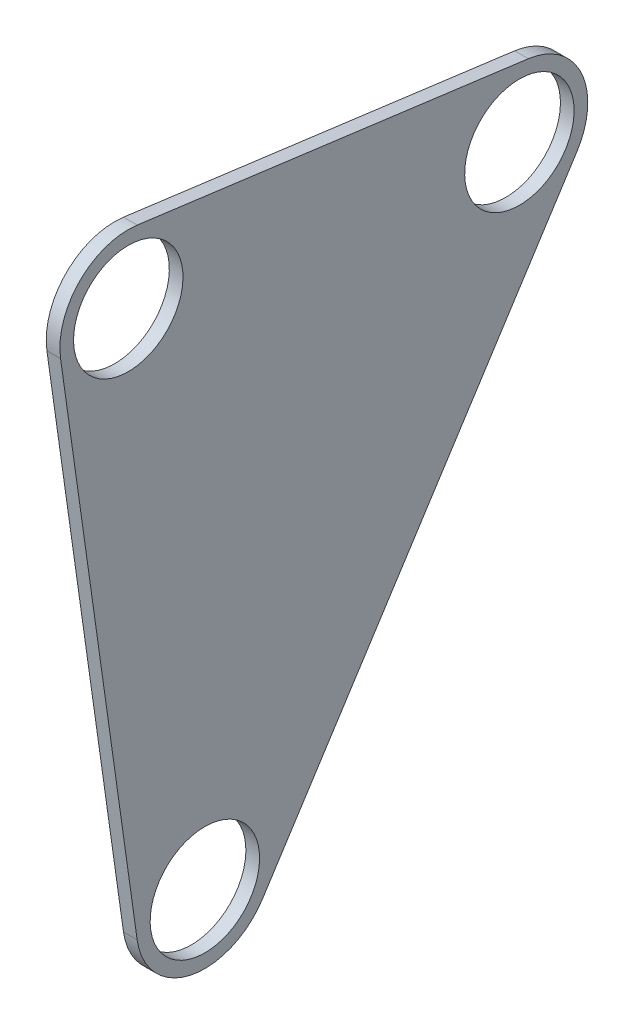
ISO-10303-21;
HEADER;
FILE_DESCRIPTION(('STEP AP214'),'2;1');
FILE_NAME('part.step','',(''),(''),'','','');
FILE_SCHEMA(('AUTOMOTIVE_DESIGN { 1 0 10303 214 1 1 1 1 }'));
ENDSEC;
DATA;
#1=APPLICATION_CONTEXT('core data for automotive mechanical design processes');
#2=APPLICATION_PROTOCOL_DEFINITION('international standard','automotive_design',2000,#1);
#3=PRODUCT_CONTEXT('',#1,'mechanical');
#4=PRODUCT('Part','Part','',(#3));
#5=PRODUCT_RELATED_PRODUCT_CATEGORY('part','',(#4));
#6=PRODUCT_DEFINITION_FORMATION('','',#4);
#7=PRODUCT_DEFINITION_CONTEXT('part definition',#1,'design');
#8=PRODUCT_DEFINITION('design','',#6,#7);
#9=PRODUCT_DEFINITION_SHAPE('','',#8);
#10=(LENGTH_UNIT() NAMED_UNIT(*) SI_UNIT(.MILLI.,.METRE.));
#11=(NAMED_UNIT(*) PLANE_ANGLE_UNIT() SI_UNIT($,.RADIAN.));
#12=(NAMED_UNIT(*) SI_UNIT($,.STERADIAN.) SOLID_ANGLE_UNIT());
#13=UNCERTAINTY_MEASURE_WITH_UNIT(LENGTH_MEASURE(1.E-05),#10,'distance_accuracy_value','');
#14=(GEOMETRIC_REPRESENTATION_CONTEXT(3) GLOBAL_UNCERTAINTY_ASSIGNED_CONTEXT((#13)) GLOBAL_UNIT_ASSIGNED_CONTEXT((#10,
#11,#12)) REPRESENTATION_CONTEXT('',''));
#15=CARTESIAN_POINT('',(0.,0.,0.));
#16=DIRECTION('',(0.,0.,1.));
#17=DIRECTION('',(1.,0.,0.));
#18=AXIS2_PLACEMENT_3D('',#15,#16,#17);
#19=CARTESIAN_POINT('',(525.90938788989,1343.37657091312,1445.07249873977));
#20=DIRECTION('',(-1.,0.,0.));
#21=DIRECTION('',(0.,-1.,0.));
#22=AXIS2_PLACEMENT_3D('',#19,#20,#21);
#23=PLANE('',#22);
#24=CARTESIAN_POINT('',(525.90938788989,1343.37657091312,1445.07249873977));
#25=DIRECTION('',(1.,0.,0.));
#26=DIRECTION('',(0.,-1.,0.));
#27=AXIS2_PLACEMENT_3D('',#24,#25,#26);
#28=CIRCLE('',#27,12.5);
#29=CARTESIAN_POINT('',(525.90938788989,1355.76963168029,1443.44092133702));
#30=VERTEX_POINT('',#29);
#31=CARTESIAN_POINT('',(525.90938788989,1341.62657091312,1457.44939253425));
#32=VERTEX_POINT('',#31);
#33=EDGE_CURVE('E128',#30,#32,#28,.T.);
#34=ORIENTED_EDGE('',*,*,#33,.T.);
#35=DIRECTION('',(0.,-0.990151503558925,-0.139999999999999));
#36=VECTOR('',#35,1.);
#37=CARTESIAN_POINT('',(525.90938788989,1242.61142055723,1443.44939253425));
#38=LINE('',#37,#36);
#39=CARTESIAN_POINT('',(525.90938788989,1242.61142055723,1443.44939253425));
#40=VERTEX_POINT('',#39);
#41=EDGE_CURVE('E86',#32,#40,#38,.T.);
#42=ORIENTED_EDGE('',*,*,#41,.T.);
#43=CARTESIAN_POINT('',(525.90938788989,1244.36142055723,1431.07249873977));
#44=DIRECTION('',(1.,0.,0.));
#45=DIRECTION('',(0.,-1.,0.));
#46=AXIS2_PLACEMENT_3D('',#43,#44,#45);
#47=CIRCLE('',#46,12.4999999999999);
#48=CARTESIAN_POINT('',(525.90938788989,1237.61036715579,1420.55236195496));
#49=VERTEX_POINT('',#48);
#50=EDGE_CURVE('E99',#40,#49,#47,.T.);
#51=ORIENTED_EDGE('',*,*,#50,.T.);
#52=DIRECTION('',(0.,0.841610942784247,-0.540084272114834));
#53=VECTOR('',#52,1.);
#54=CARTESIAN_POINT('',(525.90938788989,1237.61036715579,1420.55236195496));
#55=LINE('',#54,#53);
#56=CARTESIAN_POINT('',(525.90938788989,1327.21236393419,1363.05236195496));
#57=VERTEX_POINT('',#56);
#58=EDGE_CURVE('E93',#49,#57,#55,.T.);
#59=ORIENTED_EDGE('',*,*,#58,.T.);
#60=CARTESIAN_POINT('',(525.90938788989,1333.96341733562,1373.57249873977));
#61=DIRECTION('',(1.,0.,0.));
#62=DIRECTION('',(0.,-1.,0.));
#63=AXIS2_PLACEMENT_3D('',#60,#61,#62);
#64=CIRCLE('',#63,12.5000000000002);
#65=CARTESIAN_POINT('',(525.90938788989,1346.3564781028,1371.94092133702));
#66=VERTEX_POINT('',#65);
#67=EDGE_CURVE('E97',#57,#66,#64,.T.);
#68=ORIENTED_EDGE('',*,*,#67,.T.);
#69=DIRECTION('',(0.,0.130526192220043,0.991444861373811));
#70=VECTOR('',#69,1.);
#71=CARTESIAN_POINT('',(525.90938788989,1346.3564781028,1371.94092133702));
#72=LINE('',#71,#70);
#73=EDGE_CURVE('E49',#66,#30,#72,.T.);
#74=ORIENTED_EDGE('',*,*,#73,.T.);
#75=EDGE_LOOP('',(#34,#42,#51,#59,#68,#74));
#76=FACE_BOUND('',#75,.T.);
#77=CARTESIAN_POINT('',(525.90938788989,1343.37657091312,1445.07249873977));
#78=DIRECTION('',(1.,0.,0.));
#79=DIRECTION('',(0.,1.,0.));
#80=AXIS2_PLACEMENT_3D('',#77,#78,#79);
#81=CIRCLE('',#80,10.0000000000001);
#82=CARTESIAN_POINT('',(525.90938788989,1353.37657091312,1445.07249873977));
#83=VERTEX_POINT('',#82);
#84=EDGE_CURVE('E121',#83,#83,#81,.T.);
#85=ORIENTED_EDGE('',*,*,#84,.F.);
#86=EDGE_LOOP('',(#85));
#87=FACE_BOUND('',#86,.T.);
#88=CARTESIAN_POINT('',(525.90938788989,1244.36142055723,1431.07249873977));
#89=DIRECTION('',(1.,0.,0.));
#90=DIRECTION('',(0.,1.,0.));
#91=AXIS2_PLACEMENT_3D('',#88,#89,#90);
#92=CIRCLE('',#91,10.0000000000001);
#93=CARTESIAN_POINT('',(525.90938788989,1254.36142055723,1431.07249873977));
#94=VERTEX_POINT('',#93);
#95=EDGE_CURVE('E182',#94,#94,#92,.T.);
#96=ORIENTED_EDGE('',*,*,#95,.F.);
#97=EDGE_LOOP('',(#96));
#98=FACE_BOUND('',#97,.T.);
#99=CARTESIAN_POINT('',(525.90938788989,1333.96341733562,1373.57249873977));
#100=DIRECTION('',(1.,0.,0.));
#101=DIRECTION('',(0.,1.,0.));
#102=AXIS2_PLACEMENT_3D('',#99,#100,#101);
#103=CIRCLE('',#102,10.0000000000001);
#104=CARTESIAN_POINT('',(525.90938788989,1343.96341733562,1373.57249873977));
#105=VERTEX_POINT('',#104);
#106=EDGE_CURVE('E173',#105,#105,#103,.T.);
#107=ORIENTED_EDGE('',*,*,#106,.F.);
#108=EDGE_LOOP('',(#107));
#109=FACE_BOUND('',#108,.T.);
#110=ADVANCED_FACE('F32',(#76,#87,#98,#109),#23,.F.);
#111=CARTESIAN_POINT('',(523.40938788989,1343.37657091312,1445.07249873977));
#112=DIRECTION('',(-1.,0.,0.));
#113=DIRECTION('',(0.,-1.,0.));
#114=AXIS2_PLACEMENT_3D('',#111,#112,#113);
#115=PLANE('',#114);
#116=CARTESIAN_POINT('',(523.40938788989,1244.36142055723,1431.07249873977));
#117=DIRECTION('',(1.,0.,0.));
#118=DIRECTION('',(0.,1.,0.));
#119=AXIS2_PLACEMENT_3D('',#116,#117,#118);
#120=CIRCLE('',#119,10.0000000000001);
#121=CARTESIAN_POINT('',(523.40938788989,1254.36142055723,1431.07249873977));
#122=VERTEX_POINT('',#121);
#123=EDGE_CURVE('E179',#122,#122,#120,.T.);
#124=ORIENTED_EDGE('',*,*,#123,.T.);
#125=EDGE_LOOP('',(#124));
#126=FACE_BOUND('',#125,.T.);
#127=CARTESIAN_POINT('',(523.40938788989,1343.37657091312,1445.07249873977));
#128=DIRECTION('',(1.,0.,0.));
#129=DIRECTION('',(0.,-1.,0.));
#130=AXIS2_PLACEMENT_3D('',#127,#128,#129);
#131=CIRCLE('',#130,12.5);
#132=CARTESIAN_POINT('',(523.40938788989,1355.76963168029,1443.44092133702));
#133=VERTEX_POINT('',#132);
#134=CARTESIAN_POINT('',(523.40938788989,1341.62657091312,1457.44939253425));
#135=VERTEX_POINT('',#134);
#136=EDGE_CURVE('E117',#133,#135,#131,.T.);
#137=ORIENTED_EDGE('',*,*,#136,.F.);
#138=DIRECTION('',(0.,0.130526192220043,0.991444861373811));
#139=VECTOR('',#138,1.);
#140=CARTESIAN_POINT('',(523.40938788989,1346.3564781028,1371.94092133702));
#141=LINE('',#140,#139);
#142=CARTESIAN_POINT('',(523.40938788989,1346.3564781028,1371.94092133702));
#143=VERTEX_POINT('',#142);
#144=EDGE_CURVE('E78',#143,#133,#141,.T.);
#145=ORIENTED_EDGE('',*,*,#144,.F.);
#146=CARTESIAN_POINT('',(523.40938788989,1333.96341733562,1373.57249873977));
#147=DIRECTION('',(1.,0.,0.));
#148=DIRECTION('',(0.,-1.,0.));
#149=AXIS2_PLACEMENT_3D('',#146,#147,#148);
#150=CIRCLE('',#149,12.5000000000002);
#151=CARTESIAN_POINT('',(523.40938788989,1327.21236393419,1363.05236195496));
#152=VERTEX_POINT('',#151);
#153=EDGE_CURVE('E72',#152,#143,#150,.T.);
#154=ORIENTED_EDGE('',*,*,#153,.F.);
#155=DIRECTION('',(0.,0.841610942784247,-0.540084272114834));
#156=VECTOR('',#155,1.);
#157=CARTESIAN_POINT('',(523.40938788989,1237.61036715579,1420.55236195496));
#158=LINE('',#157,#156);
#159=CARTESIAN_POINT('',(523.40938788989,1237.61036715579,1420.55236195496));
#160=VERTEX_POINT('',#159);
#161=EDGE_CURVE('E107',#160,#152,#158,.T.);
#162=ORIENTED_EDGE('',*,*,#161,.F.);
#163=CARTESIAN_POINT('',(523.40938788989,1244.36142055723,1431.07249873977));
#164=DIRECTION('',(1.,0.,0.));
#165=DIRECTION('',(0.,-1.,0.));
#166=AXIS2_PLACEMENT_3D('',#163,#164,#165);
#167=CIRCLE('',#166,12.4999999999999);
#168=CARTESIAN_POINT('',(523.40938788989,1242.61142055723,1443.44939253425));
#169=VERTEX_POINT('',#168);
#170=EDGE_CURVE('E123',#169,#160,#167,.T.);
#171=ORIENTED_EDGE('',*,*,#170,.F.);
#172=DIRECTION('',(0.,-0.990151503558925,-0.139999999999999));
#173=VECTOR('',#172,1.);
#174=CARTESIAN_POINT('',(523.40938788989,1242.61142055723,1443.44939253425));
#175=LINE('',#174,#173);
#176=EDGE_CURVE('E120',#135,#169,#175,.T.);
#177=ORIENTED_EDGE('',*,*,#176,.F.);
#178=EDGE_LOOP('',(#137,#145,#154,#162,#171,#177));
#179=FACE_BOUND('',#178,.T.);
#180=CARTESIAN_POINT('',(523.40938788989,1343.37657091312,1445.07249873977));
#181=DIRECTION('',(1.,0.,0.));
#182=DIRECTION('',(0.,1.,0.));
#183=AXIS2_PLACEMENT_3D('',#180,#181,#182);
#184=CIRCLE('',#183,10.0000000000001);
#185=CARTESIAN_POINT('',(523.40938788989,1353.37657091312,1445.07249873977));
#186=VERTEX_POINT('',#185);
#187=EDGE_CURVE('E185',#186,#186,#184,.T.);
#188=ORIENTED_EDGE('',*,*,#187,.T.);
#189=EDGE_LOOP('',(#188));
#190=FACE_BOUND('',#189,.T.);
#191=CARTESIAN_POINT('',(523.40938788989,1333.96341733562,1373.57249873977));
#192=DIRECTION('',(1.,0.,0.));
#193=DIRECTION('',(0.,1.,0.));
#194=AXIS2_PLACEMENT_3D('',#191,#192,#193);
#195=CIRCLE('',#194,10.0000000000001);
#196=CARTESIAN_POINT('',(523.40938788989,1343.96341733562,1373.57249873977));
#197=VERTEX_POINT('',#196);
#198=EDGE_CURVE('E176',#197,#197,#195,.T.);
#199=ORIENTED_EDGE('',*,*,#198,.T.);
#200=EDGE_LOOP('',(#199));
#201=FACE_BOUND('',#200,.T.);
#202=ADVANCED_FACE('F137',(#126,#179,#190,#201),#115,.T.);
#203=CARTESIAN_POINT('',(525.90938788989,1343.37657091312,1445.07249873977));
#204=DIRECTION('',(-1.,0.,0.));
#205=DIRECTION('',(0.,-1.,0.));
#206=AXIS2_PLACEMENT_3D('',#203,#204,#205);
#207=CYLINDRICAL_SURFACE('',#206,12.5);
#208=ORIENTED_EDGE('',*,*,#136,.T.);
#209=DIRECTION('',(-1.,0.,0.));
#210=VECTOR('',#209,1.);
#211=CARTESIAN_POINT('',(525.90938788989,1341.62657091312,1457.44939253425));
#212=LINE('',#211,#210);
#213=EDGE_CURVE('E11',#32,#135,#212,.T.);
#214=ORIENTED_EDGE('',*,*,#213,.F.);
#215=ORIENTED_EDGE('',*,*,#33,.F.);
#216=DIRECTION('',(-1.,0.,0.));
#217=VECTOR('',#216,1.);
#218=CARTESIAN_POINT('',(525.90938788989,1355.76963168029,1443.44092133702));
#219=LINE('',#218,#217);
#220=EDGE_CURVE('E113',#30,#133,#219,.T.);
#221=ORIENTED_EDGE('',*,*,#220,.T.);
#222=EDGE_LOOP('',(#208,#214,#215,#221));
#223=FACE_BOUND('',#222,.T.);
#224=ADVANCED_FACE('F34',(#223),#207,.T.);
#225=CARTESIAN_POINT('',(525.90938788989,1242.61142055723,1443.44939253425));
#226=DIRECTION('',(0.,0.139999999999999,-0.990151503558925));
#227=DIRECTION('',(0.,0.990151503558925,0.139999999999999));
#228=AXIS2_PLACEMENT_3D('',#225,#226,#227);
#229=PLANE('',#228);
#230=ORIENTED_EDGE('',*,*,#176,.T.);
#231=DIRECTION('',(-1.,0.,0.));
#232=VECTOR('',#231,1.);
#233=CARTESIAN_POINT('',(525.90938788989,1242.61142055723,1443.44939253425));
#234=LINE('',#233,#232);
#235=EDGE_CURVE('E41',#40,#169,#234,.T.);
#236=ORIENTED_EDGE('',*,*,#235,.F.);
#237=ORIENTED_EDGE('',*,*,#41,.F.);
#238=ORIENTED_EDGE('',*,*,#213,.T.);
#239=EDGE_LOOP('',(#230,#236,#237,#238));
#240=FACE_BOUND('',#239,.T.);
#241=ADVANCED_FACE('F236',(#240),#229,.F.);
#242=CARTESIAN_POINT('',(525.90938788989,1244.36142055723,1431.07249873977));
#243=DIRECTION('',(-1.,0.,0.));
#244=DIRECTION('',(0.,-1.,0.));
#245=AXIS2_PLACEMENT_3D('',#242,#243,#244);
#246=CYLINDRICAL_SURFACE('',#245,12.4999999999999);
#247=ORIENTED_EDGE('',*,*,#170,.T.);
#248=DIRECTION('',(-1.,0.,0.));
#249=VECTOR('',#248,1.);
#250=CARTESIAN_POINT('',(525.90938788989,1237.61036715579,1420.55236195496));
#251=LINE('',#250,#249);
#252=EDGE_CURVE('E108',#49,#160,#251,.T.);
#253=ORIENTED_EDGE('',*,*,#252,.F.);
#254=ORIENTED_EDGE('',*,*,#50,.F.);
#255=ORIENTED_EDGE('',*,*,#235,.T.);
#256=EDGE_LOOP('',(#247,#253,#254,#255));
#257=FACE_BOUND('',#256,.T.);
#258=ADVANCED_FACE('F134',(#257),#246,.T.);
#259=CARTESIAN_POINT('',(525.90938788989,1237.61036715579,1420.55236195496));
#260=DIRECTION('',(0.,0.540084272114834,0.841610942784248));
#261=DIRECTION('',(0.,-0.841610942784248,0.540084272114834));
#262=AXIS2_PLACEMENT_3D('',#259,#260,#261);
#263=PLANE('',#262);
#264=ORIENTED_EDGE('',*,*,#161,.T.);
#265=DIRECTION('',(-1.,0.,0.));
#266=VECTOR('',#265,1.);
#267=CARTESIAN_POINT('',(525.90938788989,1327.21236393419,1363.05236195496));
#268=LINE('',#267,#266);
#269=EDGE_CURVE('E104',#57,#152,#268,.T.);
#270=ORIENTED_EDGE('',*,*,#269,.F.);
#271=ORIENTED_EDGE('',*,*,#58,.F.);
#272=ORIENTED_EDGE('',*,*,#252,.T.);
#273=EDGE_LOOP('',(#264,#270,#271,#272));
#274=FACE_BOUND('',#273,.T.);
#275=ADVANCED_FACE('F105',(#274),#263,.F.);
#276=CARTESIAN_POINT('',(525.90938788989,1333.96341733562,1373.57249873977));
#277=DIRECTION('',(-1.,0.,0.));
#278=DIRECTION('',(0.,-1.,0.));
#279=AXIS2_PLACEMENT_3D('',#276,#277,#278);
#280=CYLINDRICAL_SURFACE('',#279,12.5000000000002);
#281=ORIENTED_EDGE('',*,*,#153,.T.);
#282=DIRECTION('',(-1.,0.,0.));
#283=VECTOR('',#282,1.);
#284=CARTESIAN_POINT('',(525.90938788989,1346.3564781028,1371.94092133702));
#285=LINE('',#284,#283);
#286=EDGE_CURVE('E109',#66,#143,#285,.T.);
#287=ORIENTED_EDGE('',*,*,#286,.F.);
#288=ORIENTED_EDGE('',*,*,#67,.F.);
#289=ORIENTED_EDGE('',*,*,#269,.T.);
#290=EDGE_LOOP('',(#281,#287,#288,#289));
#291=FACE_BOUND('',#290,.T.);
#292=ADVANCED_FACE('F111',(#291),#280,.T.);
#293=CARTESIAN_POINT('',(525.90938788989,1346.3564781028,1371.94092133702));
#294=DIRECTION('',(0.,-0.991444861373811,0.130526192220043));
#295=DIRECTION('',(0.,-0.130526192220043,-0.991444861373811));
#296=AXIS2_PLACEMENT_3D('',#293,#294,#295);
#297=PLANE('',#296);
#298=ORIENTED_EDGE('',*,*,#144,.T.);
#299=ORIENTED_EDGE('',*,*,#220,.F.);
#300=ORIENTED_EDGE('',*,*,#73,.F.);
#301=ORIENTED_EDGE('',*,*,#286,.T.);
#302=EDGE_LOOP('',(#298,#299,#300,#301));
#303=FACE_BOUND('',#302,.T.);
#304=ADVANCED_FACE('F142',(#303),#297,.F.);
#305=CARTESIAN_POINT('',(525.90938788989,1343.37657091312,1445.07249873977));
#306=DIRECTION('',(-1.,0.,0.));
#307=DIRECTION('',(0.,-1.,0.));
#308=AXIS2_PLACEMENT_3D('',#305,#306,#307);
#309=CYLINDRICAL_SURFACE('',#308,10.0000000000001);
#310=ORIENTED_EDGE('',*,*,#84,.T.);
#311=EDGE_LOOP('',(#310));
#312=FACE_BOUND('',#311,.T.);
#313=ORIENTED_EDGE('',*,*,#187,.F.);
#314=EDGE_LOOP('',(#313));
#315=FACE_BOUND('',#314,.T.);
#316=ADVANCED_FACE('F144',(#312,#315),#309,.F.);
#317=CARTESIAN_POINT('',(525.90938788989,1244.36142055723,1431.07249873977));
#318=DIRECTION('',(-1.,0.,0.));
#319=DIRECTION('',(0.,-1.,0.));
#320=AXIS2_PLACEMENT_3D('',#317,#318,#319);
#321=CYLINDRICAL_SURFACE('',#320,10.0000000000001);
#322=ORIENTED_EDGE('',*,*,#95,.T.);
#323=EDGE_LOOP('',(#322));
#324=FACE_BOUND('',#323,.T.);
#325=ORIENTED_EDGE('',*,*,#123,.F.);
#326=EDGE_LOOP('',(#325));
#327=FACE_BOUND('',#326,.T.);
#328=ADVANCED_FACE('F150',(#324,#327),#321,.F.);
#329=CARTESIAN_POINT('',(525.90938788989,1333.96341733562,1373.57249873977));
#330=DIRECTION('',(-1.,0.,0.));
#331=DIRECTION('',(0.,-1.,0.));
#332=AXIS2_PLACEMENT_3D('',#329,#330,#331);
#333=CYLINDRICAL_SURFACE('',#332,10.0000000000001);
#334=ORIENTED_EDGE('',*,*,#106,.T.);
#335=EDGE_LOOP('',(#334));
#336=FACE_BOUND('',#335,.T.);
#337=ORIENTED_EDGE('',*,*,#198,.F.);
#338=EDGE_LOOP('',(#337));
#339=FACE_BOUND('',#338,.T.);
#340=ADVANCED_FACE('F164',(#336,#339),#333,.F.);
#341=CLOSED_SHELL('',(#110,#202,#224,#241,#258,#275,#292,#304,#316,#328,#340));
#342=MANIFOLD_SOLID_BREP('B2',#341);
#343=ADVANCED_BREP_SHAPE_REPRESENTATION('',(#18,#342),#14);
#344=SHAPE_DEFINITION_REPRESENTATION(#9,#343);
ENDSEC;
END-ISO-10303-21;
